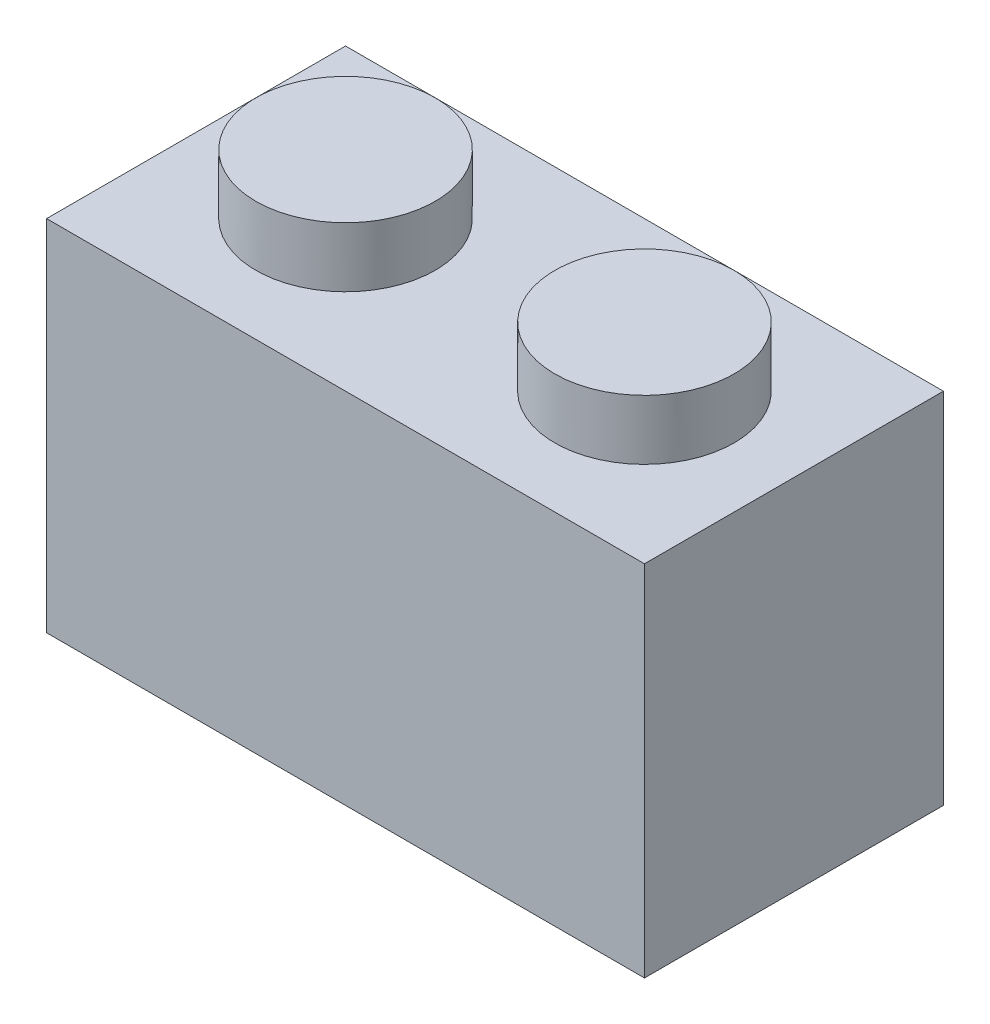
ISO-10303-21;
HEADER;
FILE_DESCRIPTION(('STEP AP214'),'2;1');
FILE_NAME('part.step','',(''),(''),'','','');
FILE_SCHEMA(('AUTOMOTIVE_DESIGN { 1 0 10303 214 1 1 1 1 }'));
ENDSEC;
DATA;
#1=APPLICATION_CONTEXT('core data for automotive mechanical design processes');
#2=APPLICATION_PROTOCOL_DEFINITION('international standard','automotive_design',2000,#1);
#3=PRODUCT_CONTEXT('',#1,'mechanical');
#4=PRODUCT('Part','Part','',(#3));
#5=PRODUCT_RELATED_PRODUCT_CATEGORY('part','',(#4));
#6=PRODUCT_DEFINITION_FORMATION('','',#4);
#7=PRODUCT_DEFINITION_CONTEXT('part definition',#1,'design');
#8=PRODUCT_DEFINITION('design','',#6,#7);
#9=PRODUCT_DEFINITION_SHAPE('','',#8);
#10=(LENGTH_UNIT() NAMED_UNIT(*) SI_UNIT(.MILLI.,.METRE.));
#11=(NAMED_UNIT(*) PLANE_ANGLE_UNIT() SI_UNIT($,.RADIAN.));
#12=(NAMED_UNIT(*) SI_UNIT($,.STERADIAN.) SOLID_ANGLE_UNIT());
#13=UNCERTAINTY_MEASURE_WITH_UNIT(LENGTH_MEASURE(1.E-05),#10,'distance_accuracy_value','');
#14=(GEOMETRIC_REPRESENTATION_CONTEXT(3) GLOBAL_UNCERTAINTY_ASSIGNED_CONTEXT((#13)) GLOBAL_UNIT_ASSIGNED_CONTEXT((#10,
#11,#12)) REPRESENTATION_CONTEXT('',''));
#15=CARTESIAN_POINT('',(0.,0.,0.));
#16=DIRECTION('',(0.,0.,1.));
#17=DIRECTION('',(1.,0.,0.));
#18=AXIS2_PLACEMENT_3D('',#15,#16,#17);
#19=CARTESIAN_POINT('',(-8.,9.6,-2.4));
#20=DIRECTION('',(0.,0.,1.));
#21=DIRECTION('',(1.,0.,0.));
#22=AXIS2_PLACEMENT_3D('',#19,#20,#21);
#23=PLANE('',#22);
#24=DIRECTION('',(0.,-1.,0.));
#25=VECTOR('',#24,1.);
#26=CARTESIAN_POINT('',(0.4,13.7688820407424,-2.4));
#27=LINE('',#26,#25);
#28=CARTESIAN_POINT('',(0.4,8.,-2.4));
#29=VERTEX_POINT('',#28);
#30=CARTESIAN_POINT('',(0.399999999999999,0.,-2.4));
#31=VERTEX_POINT('',#30);
#32=EDGE_CURVE('E57',#29,#31,#27,.T.);
#33=ORIENTED_EDGE('',*,*,#32,.T.);
#34=DIRECTION('',(-1.,0.,0.));
#35=VECTOR('',#34,1.);
#36=CARTESIAN_POINT('',(0.,0.,-2.4));
#37=LINE('',#36,#35);
#38=CARTESIAN_POINT('',(6.4,0.,-2.4));
#39=VERTEX_POINT('',#38);
#40=EDGE_CURVE('E246',#39,#31,#37,.T.);
#41=ORIENTED_EDGE('',*,*,#40,.F.);
#42=DIRECTION('',(0.,-1.,0.));
#43=VECTOR('',#42,1.);
#44=CARTESIAN_POINT('',(6.4,9.6,-2.4));
#45=LINE('',#44,#43);
#46=CARTESIAN_POINT('',(6.4,8.,-2.4));
#47=VERTEX_POINT('',#46);
#48=EDGE_CURVE('E202',#47,#39,#45,.T.);
#49=ORIENTED_EDGE('',*,*,#48,.F.);
#50=DIRECTION('',(-1.,0.,0.));
#51=VECTOR('',#50,1.);
#52=CARTESIAN_POINT('',(0.,8.,-2.4));
#53=LINE('',#52,#51);
#54=EDGE_CURVE('E218',#47,#29,#53,.T.);
#55=ORIENTED_EDGE('',*,*,#54,.T.);
#56=EDGE_LOOP('',(#33,#41,#49,#55));
#57=FACE_BOUND('',#56,.T.);
#58=ADVANCED_FACE('F34',(#57),#23,.T.);
#59=CARTESIAN_POINT('',(-8.,9.6,2.4));
#60=DIRECTION('',(0.,0.,-1.));
#61=DIRECTION('',(-1.,0.,0.));
#62=AXIS2_PLACEMENT_3D('',#59,#60,#61);
#63=PLANE('',#62);
#64=DIRECTION('',(0.,-1.,0.));
#65=VECTOR('',#64,1.);
#66=CARTESIAN_POINT('',(-0.4,13.7688820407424,2.4));
#67=LINE('',#66,#65);
#68=CARTESIAN_POINT('',(-0.4,8.,2.4));
#69=VERTEX_POINT('',#68);
#70=CARTESIAN_POINT('',(-0.4,0.,2.4));
#71=VERTEX_POINT('',#70);
#72=EDGE_CURVE('E196',#69,#71,#67,.T.);
#73=ORIENTED_EDGE('',*,*,#72,.T.);
#74=DIRECTION('',(1.,0.,0.));
#75=VECTOR('',#74,1.);
#76=CARTESIAN_POINT('',(0.,0.,2.4));
#77=LINE('',#76,#75);
#78=CARTESIAN_POINT('',(-6.4,0.,2.4));
#79=VERTEX_POINT('',#78);
#80=EDGE_CURVE('E211',#79,#71,#77,.T.);
#81=ORIENTED_EDGE('',*,*,#80,.F.);
#82=DIRECTION('',(0.,-1.,0.));
#83=VECTOR('',#82,1.);
#84=CARTESIAN_POINT('',(-6.4,9.6,2.4));
#85=LINE('',#84,#83);
#86=CARTESIAN_POINT('',(-6.4,8.,2.4));
#87=VERTEX_POINT('',#86);
#88=EDGE_CURVE('E215',#87,#79,#85,.T.);
#89=ORIENTED_EDGE('',*,*,#88,.F.);
#90=DIRECTION('',(1.,0.,0.));
#91=VECTOR('',#90,1.);
#92=CARTESIAN_POINT('',(0.,8.,2.4));
#93=LINE('',#92,#91);
#94=EDGE_CURVE('E216',#87,#69,#93,.T.);
#95=ORIENTED_EDGE('',*,*,#94,.T.);
#96=EDGE_LOOP('',(#73,#81,#89,#95));
#97=FACE_BOUND('',#96,.T.);
#98=ADVANCED_FACE('F342',(#97),#63,.T.);
#99=CARTESIAN_POINT('',(0.,8.,0.));
#100=DIRECTION('',(0.,-1.,0.));
#101=DIRECTION('',(0.,0.,-1.));
#102=AXIS2_PLACEMENT_3D('',#99,#100,#101);
#103=PLANE('',#102);
#104=DIRECTION('',(0.,0.,1.));
#105=VECTOR('',#104,1.);
#106=CARTESIAN_POINT('',(-0.399999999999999,8.,-1.54919333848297));
#107=LINE('',#106,#105);
#108=CARTESIAN_POINT('',(-0.399999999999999,8.,-2.4));
#109=VERTEX_POINT('',#108);
#110=CARTESIAN_POINT('',(-0.399999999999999,8.,-1.54919333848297));
#111=VERTEX_POINT('',#110);
#112=EDGE_CURVE('E332',#109,#111,#107,.T.);
#113=ORIENTED_EDGE('',*,*,#112,.T.);
#114=CARTESIAN_POINT('',(0.,8.,0.));
#115=DIRECTION('',(0.,-1.,0.));
#116=DIRECTION('',(0.,0.,-1.));
#117=AXIS2_PLACEMENT_3D('',#114,#115,#116);
#118=CIRCLE('',#117,1.6);
#119=CARTESIAN_POINT('',(-0.4,8.,1.54919333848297));
#120=VERTEX_POINT('',#119);
#121=EDGE_CURVE('E373',#111,#120,#118,.F.);
#122=ORIENTED_EDGE('',*,*,#121,.T.);
#123=DIRECTION('',(0.,0.,1.));
#124=VECTOR('',#123,1.);
#125=CARTESIAN_POINT('',(-0.4,8.,2.4));
#126=LINE('',#125,#124);
#127=EDGE_CURVE('E188',#120,#69,#126,.T.);
#128=ORIENTED_EDGE('',*,*,#127,.T.);
#129=ORIENTED_EDGE('',*,*,#94,.F.);
#130=DIRECTION('',(0.,0.,1.));
#131=VECTOR('',#130,1.);
#132=CARTESIAN_POINT('',(-6.4,8.,0.));
#133=LINE('',#132,#131);
#134=CARTESIAN_POINT('',(-6.4,8.,-2.4));
#135=VERTEX_POINT('',#134);
#136=EDGE_CURVE('E220',#135,#87,#133,.T.);
#137=ORIENTED_EDGE('',*,*,#136,.F.);
#138=EDGE_CURVE('E210',#109,#135,#53,.T.);
#139=ORIENTED_EDGE('',*,*,#138,.F.);
#140=EDGE_LOOP('',(#113,#122,#128,#129,#137,#139));
#141=FACE_BOUND('',#140,.T.);
#142=CARTESIAN_POINT('',(-4.,8.,0.));
#143=DIRECTION('',(0.,-1.,0.));
#144=DIRECTION('',(0.,0.,-1.));
#145=AXIS2_PLACEMENT_3D('',#142,#143,#144);
#146=CIRCLE('',#145,0.8);
#147=CARTESIAN_POINT('',(-4.,8.,-0.8));
#148=VERTEX_POINT('',#147);
#149=EDGE_CURVE('E205',#148,#148,#146,.F.);
#150=ORIENTED_EDGE('',*,*,#149,.T.);
#151=EDGE_LOOP('',(#150));
#152=FACE_BOUND('',#151,.T.);
#153=ADVANCED_FACE('F311',(#141,#152),#103,.T.);
#154=CARTESIAN_POINT('',(0.,0.,0.));
#155=DIRECTION('',(0.,-1.,0.));
#156=DIRECTION('',(0.,0.,-1.));
#157=AXIS2_PLACEMENT_3D('',#154,#155,#156);
#158=PLANE('',#157);
#159=ORIENTED_EDGE('',*,*,#40,.T.);
#160=DIRECTION('',(0.,0.,1.));
#161=VECTOR('',#160,1.);
#162=CARTESIAN_POINT('',(0.4,0.,-2.4));
#163=LINE('',#162,#161);
#164=CARTESIAN_POINT('',(0.4,0.,-1.54919333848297));
#165=VERTEX_POINT('',#164);
#166=EDGE_CURVE('E160',#31,#165,#163,.T.);
#167=ORIENTED_EDGE('',*,*,#166,.T.);
#168=CARTESIAN_POINT('',(0.,0.,0.));
#169=DIRECTION('',(0.,-1.,0.));
#170=DIRECTION('',(0.,0.,-1.));
#171=AXIS2_PLACEMENT_3D('',#168,#169,#170);
#172=CIRCLE('',#171,1.6);
#173=CARTESIAN_POINT('',(0.4,0.,1.54919333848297));
#174=VERTEX_POINT('',#173);
#175=EDGE_CURVE('E154',#165,#174,#172,.T.);
#176=ORIENTED_EDGE('',*,*,#175,.T.);
#177=DIRECTION('',(0.,0.,1.));
#178=VECTOR('',#177,1.);
#179=CARTESIAN_POINT('',(0.4,0.,1.54919333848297));
#180=LINE('',#179,#178);
#181=CARTESIAN_POINT('',(0.399999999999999,0.,2.4));
#182=VERTEX_POINT('',#181);
#183=EDGE_CURVE('E164',#174,#182,#180,.T.);
#184=ORIENTED_EDGE('',*,*,#183,.T.);
#185=CARTESIAN_POINT('',(6.4,0.,2.4));
#186=VERTEX_POINT('',#185);
#187=EDGE_CURVE('E242',#182,#186,#77,.T.);
#188=ORIENTED_EDGE('',*,*,#187,.T.);
#189=DIRECTION('',(0.,0.,-1.));
#190=VECTOR('',#189,1.);
#191=CARTESIAN_POINT('',(6.4,0.,0.));
#192=LINE('',#191,#190);
#193=EDGE_CURVE('E235',#186,#39,#192,.T.);
#194=ORIENTED_EDGE('',*,*,#193,.T.);
#195=EDGE_LOOP('',(#159,#167,#176,#184,#188,#194));
#196=FACE_BOUND('',#195,.T.);
#197=DIRECTION('',(0.,0.,-1.));
#198=VECTOR('',#197,1.);
#199=CARTESIAN_POINT('',(8.,0.,4.));
#200=LINE('',#199,#198);
#201=CARTESIAN_POINT('',(8.,0.,4.));
#202=VERTEX_POINT('',#201);
#203=CARTESIAN_POINT('',(8.,0.,-4.));
#204=VERTEX_POINT('',#203);
#205=EDGE_CURVE('E253',#202,#204,#200,.T.);
#206=ORIENTED_EDGE('',*,*,#205,.F.);
#207=DIRECTION('',(1.,0.,0.));
#208=VECTOR('',#207,1.);
#209=CARTESIAN_POINT('',(-8.,0.,4.));
#210=LINE('',#209,#208);
#211=CARTESIAN_POINT('',(-8.,0.,4.));
#212=VERTEX_POINT('',#211);
#213=EDGE_CURVE('E258',#212,#202,#210,.T.);
#214=ORIENTED_EDGE('',*,*,#213,.F.);
#215=DIRECTION('',(0.,0.,1.));
#216=VECTOR('',#215,1.);
#217=CARTESIAN_POINT('',(-8.,0.,4.));
#218=LINE('',#217,#216);
#219=CARTESIAN_POINT('',(-8.,0.,-4.));
#220=VERTEX_POINT('',#219);
#221=EDGE_CURVE('E269',#220,#212,#218,.T.);
#222=ORIENTED_EDGE('',*,*,#221,.F.);
#223=DIRECTION('',(-1.,0.,0.));
#224=VECTOR('',#223,1.);
#225=CARTESIAN_POINT('',(-8.,0.,-4.));
#226=LINE('',#225,#224);
#227=EDGE_CURVE('E267',#204,#220,#226,.T.);
#228=ORIENTED_EDGE('',*,*,#227,.F.);
#229=EDGE_LOOP('',(#206,#214,#222,#228));
#230=FACE_BOUND('',#229,.T.);
#231=ORIENTED_EDGE('',*,*,#80,.T.);
#232=DIRECTION('',(0.,0.,-1.));
#233=VECTOR('',#232,1.);
#234=CARTESIAN_POINT('',(-0.4,0.,2.4));
#235=LINE('',#234,#233);
#236=CARTESIAN_POINT('',(-0.399999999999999,0.,1.54919333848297));
#237=VERTEX_POINT('',#236);
#238=EDGE_CURVE('E168',#71,#237,#235,.T.);
#239=ORIENTED_EDGE('',*,*,#238,.T.);
#240=CARTESIAN_POINT('',(0.,0.,0.));
#241=DIRECTION('',(0.,-1.,0.));
#242=DIRECTION('',(0.,0.,-1.));
#243=AXIS2_PLACEMENT_3D('',#240,#241,#242);
#244=CIRCLE('',#243,1.6);
#245=CARTESIAN_POINT('',(-0.399999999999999,0.,-1.54919333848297));
#246=VERTEX_POINT('',#245);
#247=EDGE_CURVE('E179',#237,#246,#244,.T.);
#248=ORIENTED_EDGE('',*,*,#247,.T.);
#249=DIRECTION('',(0.,0.,-1.));
#250=VECTOR('',#249,1.);
#251=CARTESIAN_POINT('',(-0.399999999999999,0.,-1.54919333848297));
#252=LINE('',#251,#250);
#253=CARTESIAN_POINT('',(-0.399999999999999,0.,-2.4));
#254=VERTEX_POINT('',#253);
#255=EDGE_CURVE('E182',#246,#254,#252,.T.);
#256=ORIENTED_EDGE('',*,*,#255,.T.);
#257=CARTESIAN_POINT('',(-6.4,0.,-2.4));
#258=VERTEX_POINT('',#257);
#259=EDGE_CURVE('E49',#254,#258,#37,.T.);
#260=ORIENTED_EDGE('',*,*,#259,.T.);
#261=DIRECTION('',(0.,0.,1.));
#262=VECTOR('',#261,1.);
#263=CARTESIAN_POINT('',(-6.4,0.,0.));
#264=LINE('',#263,#262);
#265=EDGE_CURVE('E243',#258,#79,#264,.T.);
#266=ORIENTED_EDGE('',*,*,#265,.T.);
#267=EDGE_LOOP('',(#231,#239,#248,#256,#260,#266));
#268=FACE_BOUND('',#267,.T.);
#269=ADVANCED_FACE('F170',(#196,#230,#268),#158,.T.);
#270=CARTESIAN_POINT('',(8.,9.6,4.));
#271=DIRECTION('',(-1.,0.,0.));
#272=DIRECTION('',(0.,0.,1.));
#273=AXIS2_PLACEMENT_3D('',#270,#271,#272);
#274=PLANE('',#273);
#275=ORIENTED_EDGE('',*,*,#205,.T.);
#276=DIRECTION('',(0.,-1.,0.));
#277=VECTOR('',#276,1.);
#278=CARTESIAN_POINT('',(8.,9.6,-4.));
#279=LINE('',#278,#277);
#280=CARTESIAN_POINT('',(8.,9.6,-4.));
#281=VERTEX_POINT('',#280);
#282=EDGE_CURVE('E280',#281,#204,#279,.T.);
#283=ORIENTED_EDGE('',*,*,#282,.F.);
#284=DIRECTION('',(0.,0.,-1.));
#285=VECTOR('',#284,1.);
#286=CARTESIAN_POINT('',(8.,9.6,4.));
#287=LINE('',#286,#285);
#288=CARTESIAN_POINT('',(8.,9.6,4.));
#289=VERTEX_POINT('',#288);
#290=EDGE_CURVE('E254',#289,#281,#287,.T.);
#291=ORIENTED_EDGE('',*,*,#290,.F.);
#292=DIRECTION('',(0.,-1.,0.));
#293=VECTOR('',#292,1.);
#294=CARTESIAN_POINT('',(8.,9.6,4.));
#295=LINE('',#294,#293);
#296=EDGE_CURVE('E264',#289,#202,#295,.T.);
#297=ORIENTED_EDGE('',*,*,#296,.T.);
#298=EDGE_LOOP('',(#275,#283,#291,#297));
#299=FACE_BOUND('',#298,.T.);
#300=ADVANCED_FACE('F36',(#299),#274,.F.);
#301=CARTESIAN_POINT('',(-8.,9.6,-4.));
#302=DIRECTION('',(0.,0.,1.));
#303=DIRECTION('',(1.,0.,0.));
#304=AXIS2_PLACEMENT_3D('',#301,#302,#303);
#305=PLANE('',#304);
#306=ORIENTED_EDGE('',*,*,#227,.T.);
#307=DIRECTION('',(0.,-1.,0.));
#308=VECTOR('',#307,1.);
#309=CARTESIAN_POINT('',(-8.,9.6,-4.));
#310=LINE('',#309,#308);
#311=CARTESIAN_POINT('',(-8.,9.6,-4.));
#312=VERTEX_POINT('',#311);
#313=EDGE_CURVE('E277',#312,#220,#310,.T.);
#314=ORIENTED_EDGE('',*,*,#313,.F.);
#315=DIRECTION('',(-1.,0.,0.));
#316=VECTOR('',#315,1.);
#317=CARTESIAN_POINT('',(-8.,9.6,-4.));
#318=LINE('',#317,#316);
#319=EDGE_CURVE('E257',#281,#312,#318,.T.);
#320=ORIENTED_EDGE('',*,*,#319,.F.);
#321=ORIENTED_EDGE('',*,*,#282,.T.);
#322=EDGE_LOOP('',(#306,#314,#320,#321));
#323=FACE_BOUND('',#322,.T.);
#324=ADVANCED_FACE('F301',(#323),#305,.F.);
#325=CARTESIAN_POINT('',(-8.,9.6,4.));
#326=DIRECTION('',(1.,0.,0.));
#327=DIRECTION('',(0.,0.,-1.));
#328=AXIS2_PLACEMENT_3D('',#325,#326,#327);
#329=PLANE('',#328);
#330=ORIENTED_EDGE('',*,*,#221,.T.);
#331=DIRECTION('',(0.,-1.,0.));
#332=VECTOR('',#331,1.);
#333=CARTESIAN_POINT('',(-8.,9.6,4.));
#334=LINE('',#333,#332);
#335=CARTESIAN_POINT('',(-8.,9.6,4.));
#336=VERTEX_POINT('',#335);
#337=EDGE_CURVE('E274',#336,#212,#334,.T.);
#338=ORIENTED_EDGE('',*,*,#337,.F.);
#339=DIRECTION('',(0.,0.,1.));
#340=VECTOR('',#339,1.);
#341=CARTESIAN_POINT('',(-8.,9.6,4.));
#342=LINE('',#341,#340);
#343=EDGE_CURVE('E260',#312,#336,#342,.T.);
#344=ORIENTED_EDGE('',*,*,#343,.F.);
#345=ORIENTED_EDGE('',*,*,#313,.T.);
#346=EDGE_LOOP('',(#330,#338,#344,#345));
#347=FACE_BOUND('',#346,.T.);
#348=ADVANCED_FACE('F306',(#347),#329,.F.);
#349=CARTESIAN_POINT('',(-8.,9.6,4.));
#350=DIRECTION('',(0.,0.,-1.));
#351=DIRECTION('',(-1.,0.,0.));
#352=AXIS2_PLACEMENT_3D('',#349,#350,#351);
#353=PLANE('',#352);
#354=ORIENTED_EDGE('',*,*,#213,.T.);
#355=ORIENTED_EDGE('',*,*,#296,.F.);
#356=DIRECTION('',(1.,0.,0.));
#357=VECTOR('',#356,1.);
#358=CARTESIAN_POINT('',(-8.,9.6,4.));
#359=LINE('',#358,#357);
#360=EDGE_CURVE('E262',#336,#289,#359,.T.);
#361=ORIENTED_EDGE('',*,*,#360,.F.);
#362=ORIENTED_EDGE('',*,*,#337,.T.);
#363=EDGE_LOOP('',(#354,#355,#361,#362));
#364=FACE_BOUND('',#363,.T.);
#365=ADVANCED_FACE('F290',(#364),#353,.F.);
#366=CARTESIAN_POINT('',(0.,9.6,0.));
#367=DIRECTION('',(0.,-1.,0.));
#368=DIRECTION('',(0.,0.,-1.));
#369=AXIS2_PLACEMENT_3D('',#366,#367,#368);
#370=PLANE('',#369);
#371=CARTESIAN_POINT('',(4.,9.6,0.));
#372=DIRECTION('',(0.,-1.,0.));
#373=DIRECTION('',(0.,0.,-1.));
#374=AXIS2_PLACEMENT_3D('',#371,#372,#373);
#375=CIRCLE('',#374,2.4);
#376=CARTESIAN_POINT('',(4.,9.6,-2.4));
#377=VERTEX_POINT('',#376);
#378=EDGE_CURVE('E11',#377,#377,#375,.F.);
#379=ORIENTED_EDGE('',*,*,#378,.F.);
#380=EDGE_LOOP('',(#379));
#381=FACE_BOUND('',#380,.T.);
#382=CARTESIAN_POINT('',(-4.,9.6,0.));
#383=DIRECTION('',(0.,-1.,0.));
#384=DIRECTION('',(0.,0.,-1.));
#385=AXIS2_PLACEMENT_3D('',#382,#383,#384);
#386=CIRCLE('',#385,2.4);
#387=CARTESIAN_POINT('',(-4.,9.6,-2.4));
#388=VERTEX_POINT('',#387);
#389=EDGE_CURVE('E42',#388,#388,#386,.F.);
#390=ORIENTED_EDGE('',*,*,#389,.F.);
#391=EDGE_LOOP('',(#390));
#392=FACE_BOUND('',#391,.T.);
#393=ORIENTED_EDGE('',*,*,#290,.T.);
#394=ORIENTED_EDGE('',*,*,#319,.T.);
#395=ORIENTED_EDGE('',*,*,#343,.T.);
#396=ORIENTED_EDGE('',*,*,#360,.T.);
#397=EDGE_LOOP('',(#393,#394,#395,#396));
#398=FACE_BOUND('',#397,.T.);
#399=ADVANCED_FACE('F287',(#381,#392,#398),#370,.F.);
#400=CARTESIAN_POINT('',(-4.,11.2,0.));
#401=DIRECTION('',(0.,-1.,0.));
#402=DIRECTION('',(0.,0.,-1.));
#403=AXIS2_PLACEMENT_3D('',#400,#401,#402);
#404=CYLINDRICAL_SURFACE('',#403,2.4);
#405=CARTESIAN_POINT('',(-4.,11.2,0.));
#406=DIRECTION('',(0.,1.,0.));
#407=DIRECTION('',(0.,0.,1.));
#408=AXIS2_PLACEMENT_3D('',#405,#406,#407);
#409=CIRCLE('',#408,2.4);
#410=CARTESIAN_POINT('',(-4.,11.2,2.4));
#411=VERTEX_POINT('',#410);
#412=EDGE_CURVE('E250',#411,#411,#409,.T.);
#413=ORIENTED_EDGE('',*,*,#412,.F.);
#414=EDGE_LOOP('',(#413));
#415=FACE_BOUND('',#414,.T.);
#416=ORIENTED_EDGE('',*,*,#389,.T.);
#417=EDGE_LOOP('',(#416));
#418=FACE_BOUND('',#417,.T.);
#419=ADVANCED_FACE('F285',(#415,#418),#404,.T.);
#420=CARTESIAN_POINT('',(-4.,11.2,0.));
#421=DIRECTION('',(0.,1.,0.));
#422=DIRECTION('',(0.,0.,1.));
#423=AXIS2_PLACEMENT_3D('',#420,#421,#422);
#424=PLANE('',#423);
#425=ORIENTED_EDGE('',*,*,#412,.T.);
#426=EDGE_LOOP('',(#425));
#427=FACE_BOUND('',#426,.T.);
#428=ADVANCED_FACE('F506',(#427),#424,.T.);
#429=CARTESIAN_POINT('',(4.,11.2,0.));
#430=DIRECTION('',(0.,-1.,0.));
#431=DIRECTION('',(0.,0.,-1.));
#432=AXIS2_PLACEMENT_3D('',#429,#430,#431);
#433=CYLINDRICAL_SURFACE('',#432,2.4);
#434=CARTESIAN_POINT('',(4.,11.2,0.));
#435=DIRECTION('',(0.,1.,0.));
#436=DIRECTION('',(0.,0.,1.));
#437=AXIS2_PLACEMENT_3D('',#434,#435,#436);
#438=CIRCLE('',#437,2.4);
#439=CARTESIAN_POINT('',(4.,11.2,2.4));
#440=VERTEX_POINT('',#439);
#441=EDGE_CURVE('E229',#440,#440,#438,.T.);
#442=ORIENTED_EDGE('',*,*,#441,.F.);
#443=EDGE_LOOP('',(#442));
#444=FACE_BOUND('',#443,.T.);
#445=ORIENTED_EDGE('',*,*,#378,.T.);
#446=EDGE_LOOP('',(#445));
#447=FACE_BOUND('',#446,.T.);
#448=ADVANCED_FACE('F514',(#444,#447),#433,.T.);
#449=CARTESIAN_POINT('',(4.,11.2,0.));
#450=DIRECTION('',(0.,1.,0.));
#451=DIRECTION('',(0.,0.,1.));
#452=AXIS2_PLACEMENT_3D('',#449,#450,#451);
#453=PLANE('',#452);
#454=ORIENTED_EDGE('',*,*,#441,.T.);
#455=EDGE_LOOP('',(#454));
#456=FACE_BOUND('',#455,.T.);
#457=ADVANCED_FACE('F394',(#456),#453,.T.);
#458=CARTESIAN_POINT('',(6.4,9.6,4.));
#459=DIRECTION('',(-1.,0.,0.));
#460=DIRECTION('',(0.,0.,1.));
#461=AXIS2_PLACEMENT_3D('',#458,#459,#460);
#462=PLANE('',#461);
#463=ORIENTED_EDGE('',*,*,#193,.F.);
#464=DIRECTION('',(0.,-1.,0.));
#465=VECTOR('',#464,1.);
#466=CARTESIAN_POINT('',(6.4,9.6,2.4));
#467=LINE('',#466,#465);
#468=CARTESIAN_POINT('',(6.4,8.,2.4));
#469=VERTEX_POINT('',#468);
#470=EDGE_CURVE('E212',#469,#186,#467,.T.);
#471=ORIENTED_EDGE('',*,*,#470,.F.);
#472=DIRECTION('',(0.,0.,-1.));
#473=VECTOR('',#472,1.);
#474=CARTESIAN_POINT('',(6.4,8.,0.));
#475=LINE('',#474,#473);
#476=EDGE_CURVE('E207',#469,#47,#475,.T.);
#477=ORIENTED_EDGE('',*,*,#476,.T.);
#478=ORIENTED_EDGE('',*,*,#48,.T.);
#479=EDGE_LOOP('',(#463,#471,#477,#478));
#480=FACE_BOUND('',#479,.T.);
#481=ADVANCED_FACE('F369',(#480),#462,.T.);
#482=DIRECTION('',(0.,-1.,0.));
#483=VECTOR('',#482,1.);
#484=CARTESIAN_POINT('',(-0.399999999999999,13.7688820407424,-2.4));
#485=LINE('',#484,#483);
#486=EDGE_CURVE('E190',#109,#254,#485,.T.);
#487=ORIENTED_EDGE('',*,*,#486,.F.);
#488=ORIENTED_EDGE('',*,*,#138,.T.);
#489=DIRECTION('',(0.,-1.,0.));
#490=VECTOR('',#489,1.);
#491=CARTESIAN_POINT('',(-6.4,9.6,-2.4));
#492=LINE('',#491,#490);
#493=EDGE_CURVE('E206',#135,#258,#492,.T.);
#494=ORIENTED_EDGE('',*,*,#493,.T.);
#495=ORIENTED_EDGE('',*,*,#259,.F.);
#496=EDGE_LOOP('',(#487,#488,#494,#495));
#497=FACE_BOUND('',#496,.T.);
#498=ADVANCED_FACE('F334',(#497),#23,.T.);
#499=CARTESIAN_POINT('',(-6.4,9.6,4.));
#500=DIRECTION('',(1.,0.,0.));
#501=DIRECTION('',(0.,0.,-1.));
#502=AXIS2_PLACEMENT_3D('',#499,#500,#501);
#503=PLANE('',#502);
#504=ORIENTED_EDGE('',*,*,#265,.F.);
#505=ORIENTED_EDGE('',*,*,#493,.F.);
#506=ORIENTED_EDGE('',*,*,#136,.T.);
#507=ORIENTED_EDGE('',*,*,#88,.T.);
#508=EDGE_LOOP('',(#504,#505,#506,#507));
#509=FACE_BOUND('',#508,.T.);
#510=ADVANCED_FACE('F341',(#509),#503,.T.);
#511=DIRECTION('',(0.,-1.,0.));
#512=VECTOR('',#511,1.);
#513=CARTESIAN_POINT('',(0.4,13.7688820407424,2.4));
#514=LINE('',#513,#512);
#515=CARTESIAN_POINT('',(0.4,8.,2.4));
#516=VERTEX_POINT('',#515);
#517=EDGE_CURVE('E159',#516,#182,#514,.T.);
#518=ORIENTED_EDGE('',*,*,#517,.F.);
#519=EDGE_CURVE('E223',#516,#469,#93,.T.);
#520=ORIENTED_EDGE('',*,*,#519,.T.);
#521=ORIENTED_EDGE('',*,*,#470,.T.);
#522=ORIENTED_EDGE('',*,*,#187,.F.);
#523=EDGE_LOOP('',(#518,#520,#521,#522));
#524=FACE_BOUND('',#523,.T.);
#525=ADVANCED_FACE('F345',(#524),#63,.T.);
#526=DIRECTION('',(0.,0.,-1.));
#527=VECTOR('',#526,1.);
#528=CARTESIAN_POINT('',(0.4,8.,-2.4));
#529=LINE('',#528,#527);
#530=CARTESIAN_POINT('',(0.4,8.,-1.54919333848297));
#531=VERTEX_POINT('',#530);
#532=EDGE_CURVE('E372',#531,#29,#529,.T.);
#533=ORIENTED_EDGE('',*,*,#532,.T.);
#534=ORIENTED_EDGE('',*,*,#54,.F.);
#535=ORIENTED_EDGE('',*,*,#476,.F.);
#536=ORIENTED_EDGE('',*,*,#519,.F.);
#537=DIRECTION('',(0.,0.,-1.));
#538=VECTOR('',#537,1.);
#539=CARTESIAN_POINT('',(0.4,8.,1.54919333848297));
#540=LINE('',#539,#538);
#541=CARTESIAN_POINT('',(0.4,8.,1.54919333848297));
#542=VERTEX_POINT('',#541);
#543=EDGE_CURVE('E199',#516,#542,#540,.T.);
#544=ORIENTED_EDGE('',*,*,#543,.T.);
#545=CARTESIAN_POINT('',(0.,8.,0.));
#546=DIRECTION('',(0.,-1.,0.));
#547=DIRECTION('',(0.,0.,-1.));
#548=AXIS2_PLACEMENT_3D('',#545,#546,#547);
#549=CIRCLE('',#548,1.6);
#550=EDGE_CURVE('E156',#542,#531,#549,.F.);
#551=ORIENTED_EDGE('',*,*,#550,.T.);
#552=EDGE_LOOP('',(#533,#534,#535,#536,#544,#551));
#553=FACE_BOUND('',#552,.T.);
#554=CARTESIAN_POINT('',(4.,8.,0.));
#555=DIRECTION('',(0.,-1.,0.));
#556=DIRECTION('',(0.,0.,-1.));
#557=AXIS2_PLACEMENT_3D('',#554,#555,#556);
#558=CIRCLE('',#557,0.799999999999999);
#559=CARTESIAN_POINT('',(4.,8.,-0.799999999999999));
#560=VERTEX_POINT('',#559);
#561=EDGE_CURVE('E226',#560,#560,#558,.F.);
#562=ORIENTED_EDGE('',*,*,#561,.T.);
#563=EDGE_LOOP('',(#562));
#564=FACE_BOUND('',#563,.T.);
#565=ADVANCED_FACE('F351',(#553,#564),#103,.T.);
#566=CARTESIAN_POINT('',(-4.,11.2,0.));
#567=DIRECTION('',(0.,-1.,0.));
#568=DIRECTION('',(0.,0.,-1.));
#569=AXIS2_PLACEMENT_3D('',#566,#567,#568);
#570=CYLINDRICAL_SURFACE('',#569,0.8);
#571=CARTESIAN_POINT('',(-4.,9.6,0.));
#572=DIRECTION('',(0.,1.,0.));
#573=DIRECTION('',(0.,0.,1.));
#574=AXIS2_PLACEMENT_3D('',#571,#572,#573);
#575=CIRCLE('',#574,0.8);
#576=CARTESIAN_POINT('',(-4.,9.6,0.8));
#577=VERTEX_POINT('',#576);
#578=EDGE_CURVE('E232',#577,#577,#575,.T.);
#579=ORIENTED_EDGE('',*,*,#578,.T.);
#580=EDGE_LOOP('',(#579));
#581=FACE_BOUND('',#580,.T.);
#582=ORIENTED_EDGE('',*,*,#149,.F.);
#583=EDGE_LOOP('',(#582));
#584=FACE_BOUND('',#583,.T.);
#585=ADVANCED_FACE('F360',(#581,#584),#570,.F.);
#586=CARTESIAN_POINT('',(-4.,9.6,0.));
#587=DIRECTION('',(0.,1.,0.));
#588=DIRECTION('',(0.,0.,1.));
#589=AXIS2_PLACEMENT_3D('',#586,#587,#588);
#590=PLANE('',#589);
#591=ORIENTED_EDGE('',*,*,#578,.F.);
#592=EDGE_LOOP('',(#591));
#593=FACE_BOUND('',#592,.T.);
#594=ADVANCED_FACE('F419',(#593),#590,.F.);
#595=CARTESIAN_POINT('',(4.,11.2,0.));
#596=DIRECTION('',(0.,-1.,0.));
#597=DIRECTION('',(0.,0.,-1.));
#598=AXIS2_PLACEMENT_3D('',#595,#596,#597);
#599=CYLINDRICAL_SURFACE('',#598,0.799999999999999);
#600=CARTESIAN_POINT('',(4.,9.6,0.));
#601=DIRECTION('',(0.,1.,0.));
#602=DIRECTION('',(0.,0.,1.));
#603=AXIS2_PLACEMENT_3D('',#600,#601,#602);
#604=CIRCLE('',#603,0.799999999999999);
#605=CARTESIAN_POINT('',(4.,9.6,0.799999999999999));
#606=VERTEX_POINT('',#605);
#607=EDGE_CURVE('E201',#606,#606,#604,.T.);
#608=ORIENTED_EDGE('',*,*,#607,.T.);
#609=EDGE_LOOP('',(#608));
#610=FACE_BOUND('',#609,.T.);
#611=ORIENTED_EDGE('',*,*,#561,.F.);
#612=EDGE_LOOP('',(#611));
#613=FACE_BOUND('',#612,.T.);
#614=ADVANCED_FACE('F430',(#610,#613),#599,.F.);
#615=CARTESIAN_POINT('',(4.,9.6,0.));
#616=DIRECTION('',(0.,1.,0.));
#617=DIRECTION('',(0.,0.,1.));
#618=AXIS2_PLACEMENT_3D('',#615,#616,#617);
#619=PLANE('',#618);
#620=ORIENTED_EDGE('',*,*,#607,.F.);
#621=EDGE_LOOP('',(#620));
#622=FACE_BOUND('',#621,.T.);
#623=ADVANCED_FACE('F384',(#622),#619,.F.);
#624=CARTESIAN_POINT('',(0.,13.7688820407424,0.));
#625=DIRECTION('',(0.,-1.,0.));
#626=DIRECTION('',(0.,0.,-1.));
#627=AXIS2_PLACEMENT_3D('',#624,#625,#626);
#628=CYLINDRICAL_SURFACE('',#627,1.6);
#629=ORIENTED_EDGE('',*,*,#550,.F.);
#630=DIRECTION('',(0.,-1.,0.));
#631=VECTOR('',#630,1.);
#632=CARTESIAN_POINT('',(0.4,13.7688820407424,1.54919333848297));
#633=LINE('',#632,#631);
#634=EDGE_CURVE('E149',#542,#174,#633,.T.);
#635=ORIENTED_EDGE('',*,*,#634,.T.);
#636=ORIENTED_EDGE('',*,*,#175,.F.);
#637=DIRECTION('',(0.,-1.,0.));
#638=VECTOR('',#637,1.);
#639=CARTESIAN_POINT('',(0.4,13.7688820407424,-1.54919333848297));
#640=LINE('',#639,#638);
#641=EDGE_CURVE('E186',#531,#165,#640,.T.);
#642=ORIENTED_EDGE('',*,*,#641,.F.);
#643=EDGE_LOOP('',(#629,#635,#636,#642));
#644=FACE_BOUND('',#643,.T.);
#645=ADVANCED_FACE('F151',(#644),#628,.T.);
#646=CARTESIAN_POINT('',(0.4,13.7688820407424,-2.4));
#647=DIRECTION('',(1.,0.,0.));
#648=DIRECTION('',(0.,0.,-1.));
#649=AXIS2_PLACEMENT_3D('',#646,#647,#648);
#650=PLANE('',#649);
#651=ORIENTED_EDGE('',*,*,#532,.F.);
#652=ORIENTED_EDGE('',*,*,#641,.T.);
#653=ORIENTED_EDGE('',*,*,#166,.F.);
#654=ORIENTED_EDGE('',*,*,#32,.F.);
#655=EDGE_LOOP('',(#651,#652,#653,#654));
#656=FACE_BOUND('',#655,.T.);
#657=ADVANCED_FACE('F371',(#656),#650,.T.);
#658=CARTESIAN_POINT('',(-0.399999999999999,13.7688820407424,-1.54919333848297));
#659=DIRECTION('',(-1.,0.,0.));
#660=DIRECTION('',(0.,0.,1.));
#661=AXIS2_PLACEMENT_3D('',#658,#659,#660);
#662=PLANE('',#661);
#663=ORIENTED_EDGE('',*,*,#112,.F.);
#664=ORIENTED_EDGE('',*,*,#486,.T.);
#665=ORIENTED_EDGE('',*,*,#255,.F.);
#666=DIRECTION('',(0.,-1.,0.));
#667=VECTOR('',#666,1.);
#668=CARTESIAN_POINT('',(-0.399999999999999,13.7688820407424,-1.54919333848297));
#669=LINE('',#668,#667);
#670=EDGE_CURVE('E192',#111,#246,#669,.T.);
#671=ORIENTED_EDGE('',*,*,#670,.F.);
#672=EDGE_LOOP('',(#663,#664,#665,#671));
#673=FACE_BOUND('',#672,.T.);
#674=ADVANCED_FACE('F331',(#673),#662,.T.);
#675=CARTESIAN_POINT('',(0.,13.7688820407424,0.));
#676=DIRECTION('',(0.,-1.,0.));
#677=DIRECTION('',(0.,0.,-1.));
#678=AXIS2_PLACEMENT_3D('',#675,#676,#677);
#679=CYLINDRICAL_SURFACE('',#678,1.6);
#680=ORIENTED_EDGE('',*,*,#121,.F.);
#681=ORIENTED_EDGE('',*,*,#670,.T.);
#682=ORIENTED_EDGE('',*,*,#247,.F.);
#683=DIRECTION('',(0.,-1.,0.));
#684=VECTOR('',#683,1.);
#685=CARTESIAN_POINT('',(-0.399999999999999,13.7688820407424,1.54919333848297));
#686=LINE('',#685,#684);
#687=EDGE_CURVE('E194',#120,#237,#686,.T.);
#688=ORIENTED_EDGE('',*,*,#687,.F.);
#689=EDGE_LOOP('',(#680,#681,#682,#688));
#690=FACE_BOUND('',#689,.T.);
#691=ADVANCED_FACE('F326',(#690),#679,.T.);
#692=CARTESIAN_POINT('',(-0.4,13.7688820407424,2.4));
#693=DIRECTION('',(-1.,0.,0.));
#694=DIRECTION('',(0.,0.,1.));
#695=AXIS2_PLACEMENT_3D('',#692,#693,#694);
#696=PLANE('',#695);
#697=ORIENTED_EDGE('',*,*,#127,.F.);
#698=ORIENTED_EDGE('',*,*,#687,.T.);
#699=ORIENTED_EDGE('',*,*,#238,.F.);
#700=ORIENTED_EDGE('',*,*,#72,.F.);
#701=EDGE_LOOP('',(#697,#698,#699,#700));
#702=FACE_BOUND('',#701,.T.);
#703=ADVANCED_FACE('F321',(#702),#696,.T.);
#704=CARTESIAN_POINT('',(0.4,13.7688820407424,1.54919333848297));
#705=DIRECTION('',(1.,0.,0.));
#706=DIRECTION('',(0.,0.,-1.));
#707=AXIS2_PLACEMENT_3D('',#704,#705,#706);
#708=PLANE('',#707);
#709=ORIENTED_EDGE('',*,*,#543,.F.);
#710=ORIENTED_EDGE('',*,*,#517,.T.);
#711=ORIENTED_EDGE('',*,*,#183,.F.);
#712=ORIENTED_EDGE('',*,*,#634,.F.);
#713=EDGE_LOOP('',(#709,#710,#711,#712));
#714=FACE_BOUND('',#713,.T.);
#715=ADVANCED_FACE('F165',(#714),#708,.T.);
#716=CLOSED_SHELL('',(#58,#98,#153,#269,#300,#324,#348,#365,#399,#419,#428,#448,#457,#481,#498,
#510,#525,#565,#585,#594,#614,#623,#645,#657,#674,#691,#703,#715));
#717=MANIFOLD_SOLID_BREP('B2',#716);
#718=ADVANCED_BREP_SHAPE_REPRESENTATION('',(#18,#717),#14);
#719=SHAPE_DEFINITION_REPRESENTATION(#9,#718);
ENDSEC;
END-ISO-10303-21;
